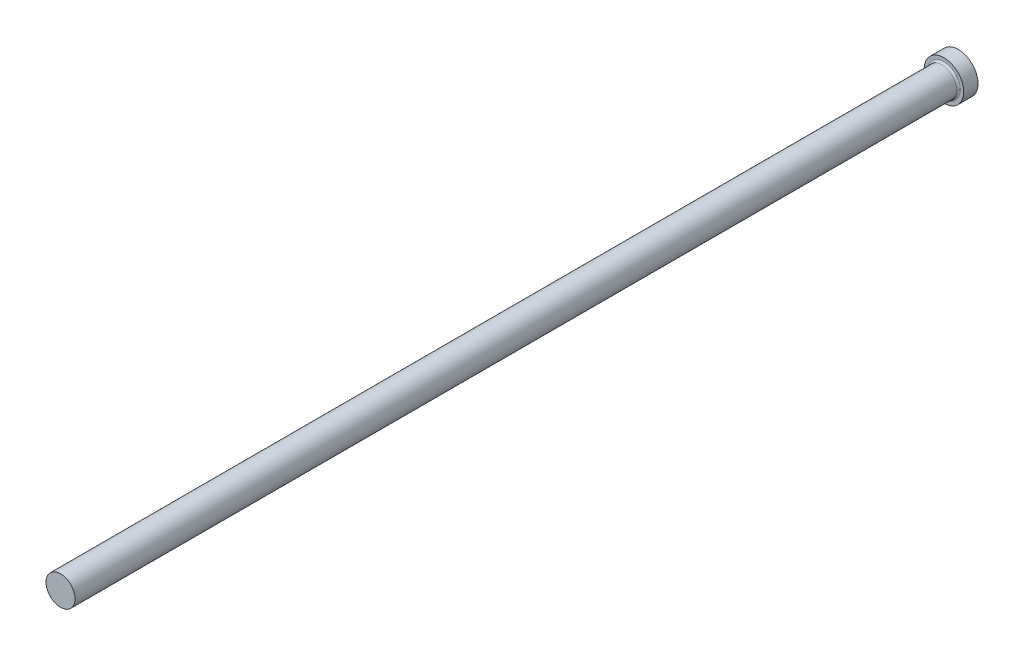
ISO-10303-21;
HEADER;
FILE_DESCRIPTION(('STEP AP214'),'2;1');
FILE_NAME('part.step','',(''),(''),'','','');
FILE_SCHEMA(('AUTOMOTIVE_DESIGN { 1 0 10303 214 1 1 1 1 }'));
ENDSEC;
DATA;
#1=APPLICATION_CONTEXT('core data for automotive mechanical design processes');
#2=APPLICATION_PROTOCOL_DEFINITION('international standard','automotive_design',2000,#1);
#3=PRODUCT_CONTEXT('',#1,'mechanical');
#4=PRODUCT('Part','Part','',(#3));
#5=PRODUCT_RELATED_PRODUCT_CATEGORY('part','',(#4));
#6=PRODUCT_DEFINITION_FORMATION('','',#4);
#7=PRODUCT_DEFINITION_CONTEXT('part definition',#1,'design');
#8=PRODUCT_DEFINITION('design','',#6,#7);
#9=PRODUCT_DEFINITION_SHAPE('','',#8);
#10=(LENGTH_UNIT() NAMED_UNIT(*) SI_UNIT(.MILLI.,.METRE.));
#11=(NAMED_UNIT(*) PLANE_ANGLE_UNIT() SI_UNIT($,.RADIAN.));
#12=(NAMED_UNIT(*) SI_UNIT($,.STERADIAN.) SOLID_ANGLE_UNIT());
#13=UNCERTAINTY_MEASURE_WITH_UNIT(LENGTH_MEASURE(1.E-05),#10,'distance_accuracy_value','');
#14=(GEOMETRIC_REPRESENTATION_CONTEXT(3) GLOBAL_UNCERTAINTY_ASSIGNED_CONTEXT((#13)) GLOBAL_UNIT_ASSIGNED_CONTEXT((#10,
#11,#12)) REPRESENTATION_CONTEXT('',''));
#15=CARTESIAN_POINT('',(0.,0.,0.));
#16=DIRECTION('',(0.,0.,1.));
#17=DIRECTION('',(1.,0.,0.));
#18=AXIS2_PLACEMENT_3D('',#15,#16,#17);
#19=CARTESIAN_POINT('',(5.5,0.,4.));
#20=DIRECTION('',(0.,0.,-1.));
#21=DIRECTION('',(-1.,0.,0.));
#22=AXIS2_PLACEMENT_3D('',#19,#20,#21);
#23=PLANE('',#22);
#24=CARTESIAN_POINT('',(0.,0.,4.));
#25=DIRECTION('',(0.,0.,-1.));
#26=DIRECTION('',(-1.,0.,0.));
#27=AXIS2_PLACEMENT_3D('',#24,#25,#26);
#28=CIRCLE('',#27,4.55000000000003);
#29=CARTESIAN_POINT('',(-4.55000000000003,0.,4.));
#30=VERTEX_POINT('',#29);
#31=EDGE_CURVE('E40',#30,#30,#28,.T.);
#32=ORIENTED_EDGE('',*,*,#31,.T.);
#33=EDGE_LOOP('',(#32));
#34=FACE_BOUND('',#33,.T.);
#35=CARTESIAN_POINT('',(0.,0.,4.));
#36=DIRECTION('',(0.,0.,-1.));
#37=DIRECTION('',(-1.,0.,0.));
#38=AXIS2_PLACEMENT_3D('',#35,#36,#37);
#39=CIRCLE('',#38,5.5);
#40=CARTESIAN_POINT('',(-5.5,0.,4.));
#41=VERTEX_POINT('',#40);
#42=EDGE_CURVE('E44',#41,#41,#39,.T.);
#43=ORIENTED_EDGE('',*,*,#42,.F.);
#44=EDGE_LOOP('',(#43));
#45=FACE_BOUND('',#44,.T.);
#46=ADVANCED_FACE('F33',(#34,#45),#23,.F.);
#47=CARTESIAN_POINT('',(0.,0.,-9.03322817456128));
#48=DIRECTION('',(0.,0.,-1.));
#49=DIRECTION('',(-1.,0.,0.));
#50=AXIS2_PLACEMENT_3D('',#47,#48,#49);
#51=CYLINDRICAL_SURFACE('',#50,5.5);
#52=CARTESIAN_POINT('',(0.,0.,0.));
#53=DIRECTION('',(0.,0.,-1.));
#54=DIRECTION('',(-1.,0.,0.));
#55=AXIS2_PLACEMENT_3D('',#52,#53,#54);
#56=CIRCLE('',#55,5.5);
#57=CARTESIAN_POINT('',(-5.5,0.,0.));
#58=VERTEX_POINT('',#57);
#59=EDGE_CURVE('E48',#58,#58,#56,.T.);
#60=ORIENTED_EDGE('',*,*,#59,.F.);
#61=EDGE_LOOP('',(#60));
#62=FACE_BOUND('',#61,.T.);
#63=ORIENTED_EDGE('',*,*,#42,.T.);
#64=EDGE_LOOP('',(#63));
#65=FACE_BOUND('',#64,.T.);
#66=ADVANCED_FACE('F68',(#62,#65),#51,.T.);
#67=CARTESIAN_POINT('',(0.,0.,0.));
#68=DIRECTION('',(0.,0.,1.));
#69=DIRECTION('',(1.,0.,0.));
#70=AXIS2_PLACEMENT_3D('',#67,#68,#69);
#71=PLANE('',#70);
#72=ORIENTED_EDGE('',*,*,#59,.T.);
#73=EDGE_LOOP('',(#72));
#74=FACE_BOUND('',#73,.T.);
#75=ADVANCED_FACE('F61',(#74),#71,.F.);
#76=CARTESIAN_POINT('',(0.,0.,250.));
#77=DIRECTION('',(0.,0.,-1.));
#78=DIRECTION('',(-1.,0.,0.));
#79=AXIS2_PLACEMENT_3D('',#76,#77,#78);
#80=PLANE('',#79);
#81=CARTESIAN_POINT('',(0.,0.,250.));
#82=DIRECTION('',(0.,0.,-1.));
#83=DIRECTION('',(-1.,0.,0.));
#84=AXIS2_PLACEMENT_3D('',#81,#82,#83);
#85=CIRCLE('',#84,4.05000000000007);
#86=CARTESIAN_POINT('',(-4.05000000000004,0.,250.));
#87=VERTEX_POINT('',#86);
#88=EDGE_CURVE('E53',#87,#87,#85,.T.);
#89=ORIENTED_EDGE('',*,*,#88,.F.);
#90=EDGE_LOOP('',(#89));
#91=FACE_BOUND('',#90,.T.);
#92=ADVANCED_FACE('F59',(#91),#80,.F.);
#93=CARTESIAN_POINT('',(0.,0.,-9.03322817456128));
#94=DIRECTION('',(0.,0.,-1.));
#95=DIRECTION('',(-1.,0.,0.));
#96=AXIS2_PLACEMENT_3D('',#93,#94,#95);
#97=CYLINDRICAL_SURFACE('',#96,4.05000000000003);
#98=CARTESIAN_POINT('',(0.,0.,4.5));
#99=DIRECTION('',(0.,0.,-1.));
#100=DIRECTION('',(-1.,0.,0.));
#101=AXIS2_PLACEMENT_3D('',#98,#99,#100);
#102=CIRCLE('',#101,4.05000000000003);
#103=CARTESIAN_POINT('',(-4.05000000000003,0.,4.5));
#104=VERTEX_POINT('',#103);
#105=EDGE_CURVE('E10',#104,#104,#102,.F.);
#106=ORIENTED_EDGE('',*,*,#105,.T.);
#107=EDGE_LOOP('',(#106));
#108=FACE_BOUND('',#107,.T.);
#109=ORIENTED_EDGE('',*,*,#88,.T.);
#110=EDGE_LOOP('',(#109));
#111=FACE_BOUND('',#110,.T.);
#112=ADVANCED_FACE('F57',(#108,#111),#97,.T.);
#113=CARTESIAN_POINT('',(0.,0.,4.5));
#114=DIRECTION('',(0.,0.,-1.));
#115=DIRECTION('',(-1.,0.,0.));
#116=AXIS2_PLACEMENT_3D('',#113,#114,#115);
#117=TOROIDAL_SURFACE('',#116,4.55000000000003,0.5);
#118=ORIENTED_EDGE('',*,*,#105,.F.);
#119=EDGE_LOOP('',(#118));
#120=FACE_BOUND('',#119,.T.);
#121=ORIENTED_EDGE('',*,*,#31,.F.);
#122=EDGE_LOOP('',(#121));
#123=FACE_BOUND('',#122,.T.);
#124=ADVANCED_FACE('F35',(#120,#123),#117,.F.);
#125=CLOSED_SHELL('',(#46,#66,#75,#92,#112,#124));
#126=MANIFOLD_SOLID_BREP('B2',#125);
#127=ADVANCED_BREP_SHAPE_REPRESENTATION('',(#18,#126),#14);
#128=SHAPE_DEFINITION_REPRESENTATION(#9,#127);
ENDSEC;
END-ISO-10303-21;
